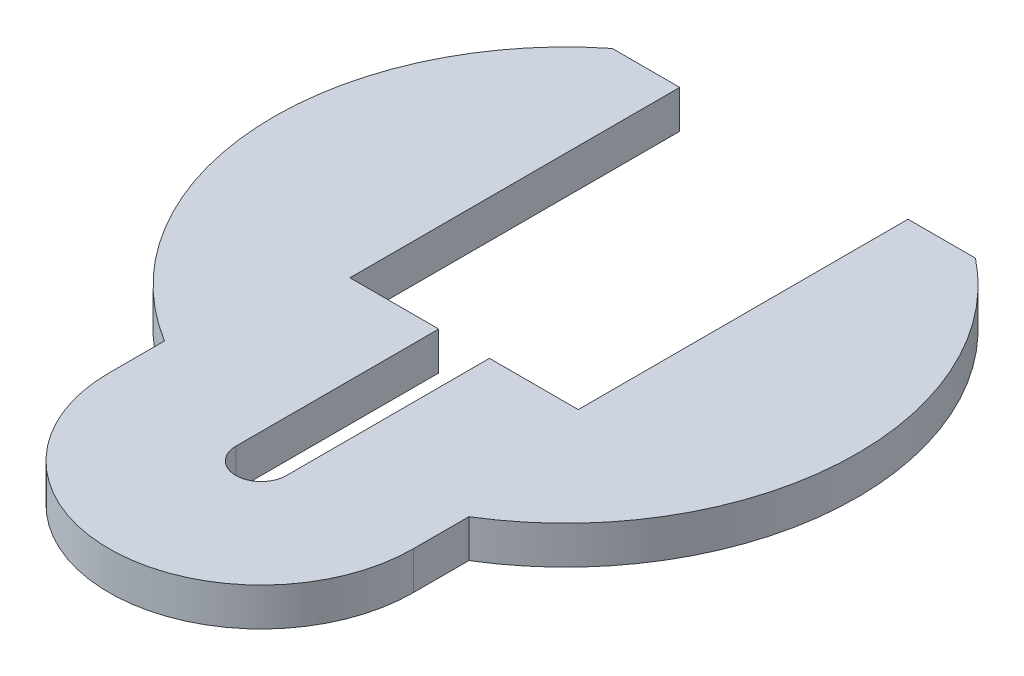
from build123d import *

# Parameters (mm, degrees)
EXTRUDE1_DEPTH = 3


with BuildPart() as part:
    # Sketch1 → Extrude1 (new body)
    with BuildSketch(Plane(origin=(0, 0, 0), x_dir=(1, 0, 0), z_dir=(0, 1, 0))):
        with BuildLine():
            Line((-9, 16), (-9, 42))
            Line((-9, 42), (-14.317821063, 42))
            ThreePointArc((-14.317821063, 42), (-22.956473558, 22.585672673), (-12, 4.37858313))
            Line((-12, 4.37858313), (-12, 0))
            ThreePointArc((-12, 0), (0, -12), (12, 0))
            Line((12, 0), (12, 4.37858313))
            ThreePointArc((12, 4.37858313), (22.956473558, 22.585672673), (14.317821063, 42))
            Line((14.317821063, 42), (9, 42))
            Line((9, 42), (9, 16))
            Line((9, 16), (2, 16))
            Line((2, 16), (2, 0))
            ThreePointArc((2, 0), (0, -2), (-2, 0))
            Line((-2, 0), (-2, 16))
            Line((-2, 16), (-9, 16))
        make_face()
    extrude(amount=EXTRUDE1_DEPTH)


solid = part.part
